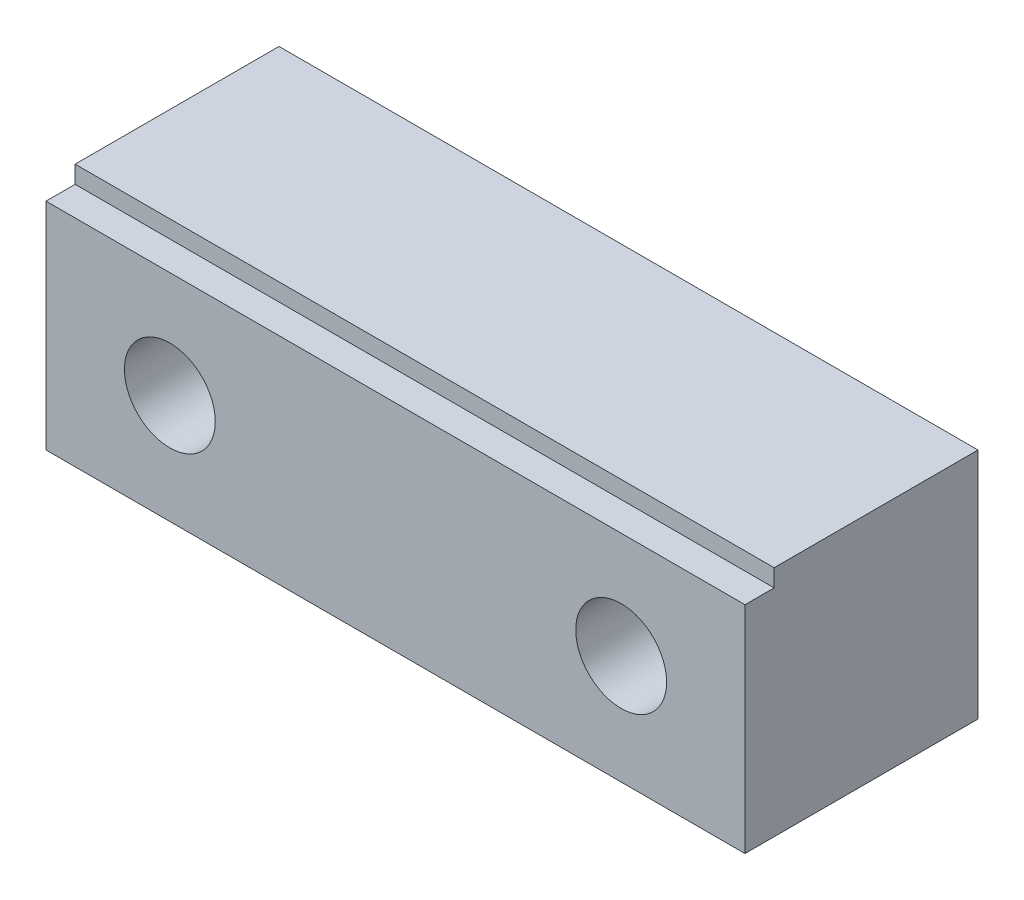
from build123d import *

# Parameters (mm, degrees)
SKETCH1_W           = 152.4
SKETCH1_H           = 50.8
BOSS_EXTRUDE1_DEPTH = 50.8
SKETCH2_R           = 9.906
CUT_EXTRUDE1_DEPTH  = 41.402
SKETCH3_R           = 6.7437
CUT_EXTRUDE2_DEPTH  = 105.726882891
SKETCH4_W           = 6.35
SKETCH4_H           = 3.81
CUT_EXTRUDE3_DEPTH  = 163.639355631


with BuildPart() as part:
    # Sketch1 → Boss-Extrude1 (new body)
    with BuildSketch(Plane(origin=(0, 0, 0), x_dir=(1, 0, 0), z_dir=(0, 1, 0))):
        Rectangle(SKETCH1_W, SKETCH1_H)
    extrude(amount=-BOSS_EXTRUDE1_DEPTH)

    # Sketch2 → Cut-Extrude1 (cut)
    with BuildSketch(Plane.XY.offset(25.4)):
        with Locations((-49.1998, -27.0002)):
            Circle(SKETCH2_R)
        with Locations((49.1998, -27.0002)):
            Circle(SKETCH2_R)
    extrude(amount=-CUT_EXTRUDE1_DEPTH, mode=Mode.SUBTRACT)

    # Sketch3 → Cut-Extrude2 (cut, through all)
    with BuildSketch(Plane.XY.offset(25.4)):
        with Locations((-49.1998, -27.0002)):
            Circle(SKETCH3_R)
        with Locations((49.1998, -27.0002)):
            Circle(SKETCH3_R)
    extrude(amount=-CUT_EXTRUDE2_DEPTH, mode=Mode.SUBTRACT)

    # Sketch4 → Cut-Extrude3 (cut, through all)
    with BuildSketch(Plane(origin=(76.2, 0, 0), x_dir=(0, 0, -1), z_dir=(1, 0, 0))):
        with Locations((-22.225, -1.905)):
            Rectangle(SKETCH4_W, SKETCH4_H)
    extrude(amount=-CUT_EXTRUDE3_DEPTH, mode=Mode.SUBTRACT)


solid = part.part
